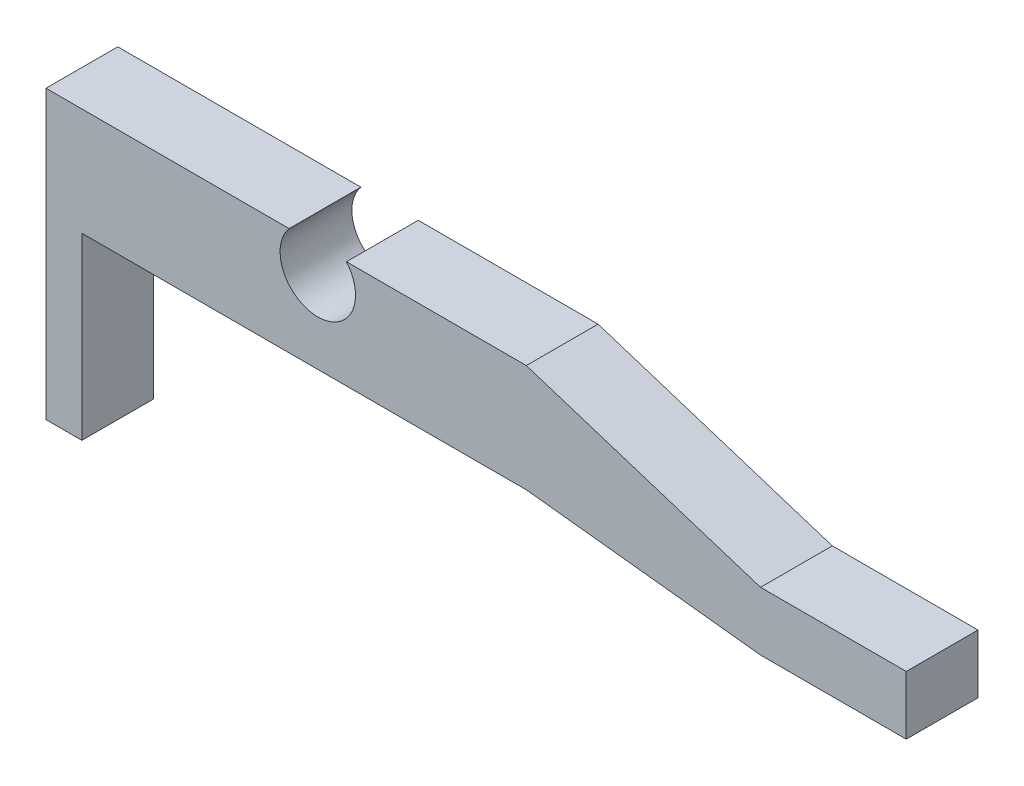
ISO-10303-21;
HEADER;
FILE_DESCRIPTION(('STEP AP214'),'2;1');
FILE_NAME('part.step','',(''),(''),'','','');
FILE_SCHEMA(('AUTOMOTIVE_DESIGN { 1 0 10303 214 1 1 1 1 }'));
ENDSEC;
DATA;
#1=APPLICATION_CONTEXT('core data for automotive mechanical design processes');
#2=APPLICATION_PROTOCOL_DEFINITION('international standard','automotive_design',2000,#1);
#3=PRODUCT_CONTEXT('',#1,'mechanical');
#4=PRODUCT('Part','Part','',(#3));
#5=PRODUCT_RELATED_PRODUCT_CATEGORY('part','',(#4));
#6=PRODUCT_DEFINITION_FORMATION('','',#4);
#7=PRODUCT_DEFINITION_CONTEXT('part definition',#1,'design');
#8=PRODUCT_DEFINITION('design','',#6,#7);
#9=PRODUCT_DEFINITION_SHAPE('','',#8);
#10=(LENGTH_UNIT() NAMED_UNIT(*) SI_UNIT(.MILLI.,.METRE.));
#11=(NAMED_UNIT(*) PLANE_ANGLE_UNIT() SI_UNIT($,.RADIAN.));
#12=(NAMED_UNIT(*) SI_UNIT($,.STERADIAN.) SOLID_ANGLE_UNIT());
#13=UNCERTAINTY_MEASURE_WITH_UNIT(LENGTH_MEASURE(1.E-05),#10,'distance_accuracy_value','');
#14=(GEOMETRIC_REPRESENTATION_CONTEXT(3) GLOBAL_UNCERTAINTY_ASSIGNED_CONTEXT((#13)) GLOBAL_UNIT_ASSIGNED_CONTEXT((#10,
#11,#12)) REPRESENTATION_CONTEXT('',''));
#15=CARTESIAN_POINT('',(0.,0.,0.));
#16=DIRECTION('',(0.,0.,1.));
#17=DIRECTION('',(1.,0.,0.));
#18=AXIS2_PLACEMENT_3D('',#15,#16,#17);
#19=CARTESIAN_POINT('',(-10.0323621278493,46.3217675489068,20.));
#20=DIRECTION('',(0.,-1.,0.));
#21=DIRECTION('',(0.,0.,-1.));
#22=AXIS2_PLACEMENT_3D('',#19,#20,#21);
#23=PLANE('',#22);
#24=DIRECTION('',(-1.,0.,0.));
#25=VECTOR('',#24,1.);
#26=CARTESIAN_POINT('',(-10.0323621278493,46.3217675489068,0.));
#27=LINE('',#26,#25);
#28=CARTESIAN_POINT('',(40.0984625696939,46.3217675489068,0.));
#29=VERTEX_POINT('',#28);
#30=CARTESIAN_POINT('',(-10.0323621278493,46.3217675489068,0.));
#31=VERTEX_POINT('',#30);
#32=EDGE_CURVE('E153',#29,#31,#27,.T.);
#33=ORIENTED_EDGE('',*,*,#32,.T.);
#34=DIRECTION('',(0.,0.,-1.));
#35=VECTOR('',#34,1.);
#36=CARTESIAN_POINT('',(-10.0323621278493,46.3217675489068,20.));
#37=LINE('',#36,#35);
#38=CARTESIAN_POINT('',(-10.0323621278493,46.3217675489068,20.));
#39=VERTEX_POINT('',#38);
#40=EDGE_CURVE('E11',#39,#31,#37,.T.);
#41=ORIENTED_EDGE('',*,*,#40,.F.);
#42=DIRECTION('',(-1.,0.,0.));
#43=VECTOR('',#42,1.);
#44=CARTESIAN_POINT('',(-10.0323621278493,46.3217675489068,20.));
#45=LINE('',#44,#43);
#46=CARTESIAN_POINT('',(40.0984625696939,46.3217675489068,20.));
#47=VERTEX_POINT('',#46);
#48=EDGE_CURVE('E175',#47,#39,#45,.T.);
#49=ORIENTED_EDGE('',*,*,#48,.F.);
#50=DIRECTION('',(0.,0.,-1.));
#51=VECTOR('',#50,1.);
#52=CARTESIAN_POINT('',(40.0984625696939,46.3217675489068,20.));
#53=LINE('',#52,#51);
#54=EDGE_CURVE('E149',#47,#29,#53,.T.);
#55=ORIENTED_EDGE('',*,*,#54,.T.);
#56=EDGE_LOOP('',(#33,#41,#49,#55));
#57=FACE_BOUND('',#56,.T.);
#58=ADVANCED_FACE('F33',(#57),#23,.F.);
#59=CARTESIAN_POINT('',(-18.0246738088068,39.4994875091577,20.));
#60=DIRECTION('',(0.,0.,-1.));
#61=DIRECTION('',(-1.,0.,0.));
#62=AXIS2_PLACEMENT_3D('',#59,#60,#61);
#63=CYLINDRICAL_SURFACE('',#62,10.5081183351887);
#64=CARTESIAN_POINT('',(-18.0246738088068,39.4994875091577,0.));
#65=DIRECTION('',(0.,0.,-1.));
#66=DIRECTION('',(1.,0.,0.));
#67=AXIS2_PLACEMENT_3D('',#64,#65,#66);
#68=CIRCLE('',#67,10.5081183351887);
#69=CARTESIAN_POINT('',(-26.0169854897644,46.3217675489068,0.));
#70=VERTEX_POINT('',#69);
#71=EDGE_CURVE('E156',#31,#70,#68,.T.);
#72=ORIENTED_EDGE('',*,*,#71,.T.);
#73=DIRECTION('',(0.,0.,-1.));
#74=VECTOR('',#73,1.);
#75=CARTESIAN_POINT('',(-26.0169854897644,46.3217675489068,20.));
#76=LINE('',#75,#74);
#77=CARTESIAN_POINT('',(-26.0169854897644,46.3217675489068,20.));
#78=VERTEX_POINT('',#77);
#79=EDGE_CURVE('E41',#78,#70,#76,.T.);
#80=ORIENTED_EDGE('',*,*,#79,.F.);
#81=CARTESIAN_POINT('',(-18.0246738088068,39.4994875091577,20.));
#82=DIRECTION('',(0.,0.,-1.));
#83=DIRECTION('',(1.,0.,0.));
#84=AXIS2_PLACEMENT_3D('',#81,#82,#83);
#85=CIRCLE('',#84,10.5081183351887);
#86=EDGE_CURVE('E104',#39,#78,#85,.T.);
#87=ORIENTED_EDGE('',*,*,#86,.F.);
#88=ORIENTED_EDGE('',*,*,#40,.T.);
#89=EDGE_LOOP('',(#72,#80,#87,#88));
#90=FACE_BOUND('',#89,.T.);
#91=ADVANCED_FACE('F253',(#90),#63,.F.);
#92=CARTESIAN_POINT('',(-93.7834032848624,46.3217675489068,20.));
#93=DIRECTION('',(0.,-1.,0.));
#94=DIRECTION('',(0.,0.,-1.));
#95=AXIS2_PLACEMENT_3D('',#92,#93,#94);
#96=PLANE('',#95);
#97=DIRECTION('',(-1.,0.,0.));
#98=VECTOR('',#97,1.);
#99=CARTESIAN_POINT('',(-93.7834032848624,46.3217675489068,0.));
#100=LINE('',#99,#98);
#101=CARTESIAN_POINT('',(-93.7834032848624,46.3217675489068,0.));
#102=VERTEX_POINT('',#101);
#103=EDGE_CURVE('E158',#70,#102,#100,.T.);
#104=ORIENTED_EDGE('',*,*,#103,.T.);
#105=DIRECTION('',(0.,0.,-1.));
#106=VECTOR('',#105,1.);
#107=CARTESIAN_POINT('',(-93.7834032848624,46.3217675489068,20.));
#108=LINE('',#107,#106);
#109=CARTESIAN_POINT('',(-93.7834032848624,46.3217675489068,20.));
#110=VERTEX_POINT('',#109);
#111=EDGE_CURVE('E194',#110,#102,#108,.T.);
#112=ORIENTED_EDGE('',*,*,#111,.F.);
#113=DIRECTION('',(-1.,0.,0.));
#114=VECTOR('',#113,1.);
#115=CARTESIAN_POINT('',(-93.7834032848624,46.3217675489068,20.));
#116=LINE('',#115,#114);
#117=EDGE_CURVE('E202',#78,#110,#116,.T.);
#118=ORIENTED_EDGE('',*,*,#117,.F.);
#119=ORIENTED_EDGE('',*,*,#79,.T.);
#120=EDGE_LOOP('',(#104,#112,#118,#119));
#121=FACE_BOUND('',#120,.T.);
#122=ADVANCED_FACE('F200',(#121),#96,.F.);
#123=CARTESIAN_POINT('',(-93.7834032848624,-33.6782324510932,20.));
#124=DIRECTION('',(1.,0.,0.));
#125=DIRECTION('',(0.,0.,-1.));
#126=AXIS2_PLACEMENT_3D('',#123,#124,#125);
#127=PLANE('',#126);
#128=DIRECTION('',(0.,-1.,0.));
#129=VECTOR('',#128,1.);
#130=CARTESIAN_POINT('',(-93.7834032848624,-33.6782324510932,0.));
#131=LINE('',#130,#129);
#132=CARTESIAN_POINT('',(-93.7834032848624,-33.6782324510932,0.));
#133=VERTEX_POINT('',#132);
#134=EDGE_CURVE('E160',#102,#133,#131,.T.);
#135=ORIENTED_EDGE('',*,*,#134,.T.);
#136=DIRECTION('',(0.,0.,-1.));
#137=VECTOR('',#136,1.);
#138=CARTESIAN_POINT('',(-93.7834032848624,-33.6782324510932,20.));
#139=LINE('',#138,#137);
#140=CARTESIAN_POINT('',(-93.7834032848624,-33.6782324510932,20.));
#141=VERTEX_POINT('',#140);
#142=EDGE_CURVE('E191',#141,#133,#139,.T.);
#143=ORIENTED_EDGE('',*,*,#142,.F.);
#144=DIRECTION('',(0.,-1.,0.));
#145=VECTOR('',#144,1.);
#146=CARTESIAN_POINT('',(-93.7834032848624,-33.6782324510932,20.));
#147=LINE('',#146,#145);
#148=EDGE_CURVE('E220',#110,#141,#147,.T.);
#149=ORIENTED_EDGE('',*,*,#148,.F.);
#150=ORIENTED_EDGE('',*,*,#111,.T.);
#151=EDGE_LOOP('',(#135,#143,#149,#150));
#152=FACE_BOUND('',#151,.T.);
#153=ADVANCED_FACE('F211',(#152),#127,.F.);
#154=CARTESIAN_POINT('',(-83.7834032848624,-33.6782324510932,20.));
#155=DIRECTION('',(0.,1.,0.));
#156=DIRECTION('',(0.,0.,1.));
#157=AXIS2_PLACEMENT_3D('',#154,#155,#156);
#158=PLANE('',#157);
#159=DIRECTION('',(1.,0.,0.));
#160=VECTOR('',#159,1.);
#161=CARTESIAN_POINT('',(-83.7834032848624,-33.6782324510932,0.));
#162=LINE('',#161,#160);
#163=CARTESIAN_POINT('',(-83.7834032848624,-33.6782324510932,0.));
#164=VERTEX_POINT('',#163);
#165=EDGE_CURVE('E162',#133,#164,#162,.T.);
#166=ORIENTED_EDGE('',*,*,#165,.T.);
#167=DIRECTION('',(0.,0.,-1.));
#168=VECTOR('',#167,1.);
#169=CARTESIAN_POINT('',(-83.7834032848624,-33.6782324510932,20.));
#170=LINE('',#169,#168);
#171=CARTESIAN_POINT('',(-83.7834032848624,-33.6782324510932,20.));
#172=VERTEX_POINT('',#171);
#173=EDGE_CURVE('E188',#172,#164,#170,.T.);
#174=ORIENTED_EDGE('',*,*,#173,.F.);
#175=DIRECTION('',(1.,0.,0.));
#176=VECTOR('',#175,1.);
#177=CARTESIAN_POINT('',(-83.7834032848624,-33.6782324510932,20.));
#178=LINE('',#177,#176);
#179=EDGE_CURVE('E217',#141,#172,#178,.T.);
#180=ORIENTED_EDGE('',*,*,#179,.F.);
#181=ORIENTED_EDGE('',*,*,#142,.T.);
#182=EDGE_LOOP('',(#166,#174,#180,#181));
#183=FACE_BOUND('',#182,.T.);
#184=ADVANCED_FACE('F215',(#183),#158,.F.);
#185=CARTESIAN_POINT('',(-83.7834032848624,16.3217675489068,20.));
#186=DIRECTION('',(-1.,0.,0.));
#187=DIRECTION('',(0.,0.,1.));
#188=AXIS2_PLACEMENT_3D('',#185,#186,#187);
#189=PLANE('',#188);
#190=DIRECTION('',(0.,1.,0.));
#191=VECTOR('',#190,1.);
#192=CARTESIAN_POINT('',(-83.7834032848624,16.3217675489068,0.));
#193=LINE('',#192,#191);
#194=CARTESIAN_POINT('',(-83.7834032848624,16.3217675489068,0.));
#195=VERTEX_POINT('',#194);
#196=EDGE_CURVE('E164',#164,#195,#193,.T.);
#197=ORIENTED_EDGE('',*,*,#196,.T.);
#198=DIRECTION('',(0.,0.,-1.));
#199=VECTOR('',#198,1.);
#200=CARTESIAN_POINT('',(-83.7834032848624,16.3217675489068,20.));
#201=LINE('',#200,#199);
#202=CARTESIAN_POINT('',(-83.7834032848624,16.3217675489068,20.));
#203=VERTEX_POINT('',#202);
#204=EDGE_CURVE('E185',#203,#195,#201,.T.);
#205=ORIENTED_EDGE('',*,*,#204,.F.);
#206=DIRECTION('',(0.,1.,0.));
#207=VECTOR('',#206,1.);
#208=CARTESIAN_POINT('',(-83.7834032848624,16.3217675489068,20.));
#209=LINE('',#208,#207);
#210=EDGE_CURVE('E219',#172,#203,#209,.T.);
#211=ORIENTED_EDGE('',*,*,#210,.F.);
#212=ORIENTED_EDGE('',*,*,#173,.T.);
#213=EDGE_LOOP('',(#197,#205,#211,#212));
#214=FACE_BOUND('',#213,.T.);
#215=ADVANCED_FACE('F266',(#214),#189,.F.);
#216=CARTESIAN_POINT('',(40.0984625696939,16.3217675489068,20.));
#217=DIRECTION('',(0.,1.,0.));
#218=DIRECTION('',(-1.,0.,0.));
#219=AXIS2_PLACEMENT_3D('',#216,#217,#218);
#220=PLANE('',#219);
#221=DIRECTION('',(1.,0.,0.));
#222=VECTOR('',#221,1.);
#223=CARTESIAN_POINT('',(40.0984625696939,16.3217675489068,0.));
#224=LINE('',#223,#222);
#225=CARTESIAN_POINT('',(40.0984625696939,16.3217675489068,0.));
#226=VERTEX_POINT('',#225);
#227=EDGE_CURVE('E166',#195,#226,#224,.T.);
#228=ORIENTED_EDGE('',*,*,#227,.T.);
#229=DIRECTION('',(0.,0.,-1.));
#230=VECTOR('',#229,1.);
#231=CARTESIAN_POINT('',(40.0984625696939,16.3217675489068,20.));
#232=LINE('',#231,#230);
#233=CARTESIAN_POINT('',(40.0984625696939,16.3217675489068,20.));
#234=VERTEX_POINT('',#233);
#235=EDGE_CURVE('E182',#234,#226,#232,.T.);
#236=ORIENTED_EDGE('',*,*,#235,.F.);
#237=DIRECTION('',(1.,0.,0.));
#238=VECTOR('',#237,1.);
#239=CARTESIAN_POINT('',(40.0984625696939,16.3217675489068,20.));
#240=LINE('',#239,#238);
#241=EDGE_CURVE('E222',#203,#234,#240,.T.);
#242=ORIENTED_EDGE('',*,*,#241,.F.);
#243=ORIENTED_EDGE('',*,*,#204,.T.);
#244=EDGE_LOOP('',(#228,#236,#242,#243));
#245=FACE_BOUND('',#244,.T.);
#246=ADVANCED_FACE('F269',(#245),#220,.F.);
#247=CARTESIAN_POINT('',(105.375029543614,9.07718764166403,20.));
#248=DIRECTION('',(0.110305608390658,0.99389771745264,0.));
#249=DIRECTION('',(-0.99389771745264,0.110305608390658,0.));
#250=AXIS2_PLACEMENT_3D('',#247,#248,#249);
#251=PLANE('',#250);
#252=DIRECTION('',(0.99389771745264,-0.110305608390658,0.));
#253=VECTOR('',#252,1.);
#254=CARTESIAN_POINT('',(105.375029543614,9.07718764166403,0.));
#255=LINE('',#254,#253);
#256=CARTESIAN_POINT('',(105.375029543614,9.07718764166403,0.));
#257=VERTEX_POINT('',#256);
#258=EDGE_CURVE('E168',#226,#257,#255,.T.);
#259=ORIENTED_EDGE('',*,*,#258,.T.);
#260=DIRECTION('',(0.,0.,-1.));
#261=VECTOR('',#260,1.);
#262=CARTESIAN_POINT('',(105.375029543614,9.07718764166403,20.));
#263=LINE('',#262,#261);
#264=CARTESIAN_POINT('',(105.375029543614,9.07718764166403,20.));
#265=VERTEX_POINT('',#264);
#266=EDGE_CURVE('E179',#265,#257,#263,.T.);
#267=ORIENTED_EDGE('',*,*,#266,.F.);
#268=DIRECTION('',(0.99389771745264,-0.110305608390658,0.));
#269=VECTOR('',#268,1.);
#270=CARTESIAN_POINT('',(105.375029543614,9.07718764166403,20.));
#271=LINE('',#270,#269);
#272=EDGE_CURVE('E228',#234,#265,#271,.T.);
#273=ORIENTED_EDGE('',*,*,#272,.F.);
#274=ORIENTED_EDGE('',*,*,#235,.T.);
#275=EDGE_LOOP('',(#259,#267,#273,#274));
#276=FACE_BOUND('',#275,.T.);
#277=ADVANCED_FACE('F234',(#276),#251,.F.);
#278=CARTESIAN_POINT('',(145.992720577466,9.07718764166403,20.));
#279=DIRECTION('',(0.,1.,0.));
#280=DIRECTION('',(-1.,0.,0.));
#281=AXIS2_PLACEMENT_3D('',#278,#279,#280);
#282=PLANE('',#281);
#283=DIRECTION('',(1.,0.,0.));
#284=VECTOR('',#283,1.);
#285=CARTESIAN_POINT('',(145.992720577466,9.07718764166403,0.));
#286=LINE('',#285,#284);
#287=CARTESIAN_POINT('',(145.992720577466,9.07718764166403,0.));
#288=VERTEX_POINT('',#287);
#289=EDGE_CURVE('E170',#257,#288,#286,.T.);
#290=ORIENTED_EDGE('',*,*,#289,.T.);
#291=DIRECTION('',(0.,0.,-1.));
#292=VECTOR('',#291,1.);
#293=CARTESIAN_POINT('',(145.992720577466,9.07718764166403,20.));
#294=LINE('',#293,#292);
#295=CARTESIAN_POINT('',(145.992720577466,9.07718764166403,20.));
#296=VERTEX_POINT('',#295);
#297=EDGE_CURVE('E144',#296,#288,#294,.T.);
#298=ORIENTED_EDGE('',*,*,#297,.F.);
#299=DIRECTION('',(1.,0.,0.));
#300=VECTOR('',#299,1.);
#301=CARTESIAN_POINT('',(145.992720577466,9.07718764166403,20.));
#302=LINE('',#301,#300);
#303=EDGE_CURVE('E135',#265,#296,#302,.T.);
#304=ORIENTED_EDGE('',*,*,#303,.F.);
#305=ORIENTED_EDGE('',*,*,#266,.T.);
#306=EDGE_LOOP('',(#290,#298,#304,#305));
#307=FACE_BOUND('',#306,.T.);
#308=ADVANCED_FACE('F238',(#307),#282,.F.);
#309=CARTESIAN_POINT('',(145.992720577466,25.4332661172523,20.));
#310=DIRECTION('',(-1.,0.,0.));
#311=DIRECTION('',(0.,0.,1.));
#312=AXIS2_PLACEMENT_3D('',#309,#310,#311);
#313=PLANE('',#312);
#314=DIRECTION('',(0.,1.,0.));
#315=VECTOR('',#314,1.);
#316=CARTESIAN_POINT('',(145.992720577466,25.4332661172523,0.));
#317=LINE('',#316,#315);
#318=CARTESIAN_POINT('',(145.992720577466,25.4332661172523,0.));
#319=VERTEX_POINT('',#318);
#320=EDGE_CURVE('E143',#288,#319,#317,.T.);
#321=ORIENTED_EDGE('',*,*,#320,.T.);
#322=DIRECTION('',(0.,0.,-1.));
#323=VECTOR('',#322,1.);
#324=CARTESIAN_POINT('',(145.992720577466,25.4332661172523,20.));
#325=LINE('',#324,#323);
#326=CARTESIAN_POINT('',(145.992720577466,25.4332661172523,20.));
#327=VERTEX_POINT('',#326);
#328=EDGE_CURVE('E140',#327,#319,#325,.T.);
#329=ORIENTED_EDGE('',*,*,#328,.F.);
#330=DIRECTION('',(0.,1.,0.));
#331=VECTOR('',#330,1.);
#332=CARTESIAN_POINT('',(145.992720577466,25.4332661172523,20.));
#333=LINE('',#332,#331);
#334=EDGE_CURVE('E129',#296,#327,#333,.T.);
#335=ORIENTED_EDGE('',*,*,#334,.F.);
#336=ORIENTED_EDGE('',*,*,#297,.T.);
#337=EDGE_LOOP('',(#321,#329,#335,#336));
#338=FACE_BOUND('',#337,.T.);
#339=ADVANCED_FACE('F141',(#338),#313,.F.);
#340=CARTESIAN_POINT('',(105.375029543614,25.4332661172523,20.));
#341=DIRECTION('',(0.,-1.,0.));
#342=DIRECTION('',(0.,0.,-1.));
#343=AXIS2_PLACEMENT_3D('',#340,#341,#342);
#344=PLANE('',#343);
#345=DIRECTION('',(-1.,0.,0.));
#346=VECTOR('',#345,1.);
#347=CARTESIAN_POINT('',(105.375029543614,25.4332661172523,0.));
#348=LINE('',#347,#346);
#349=CARTESIAN_POINT('',(105.375029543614,25.4332661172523,0.));
#350=VERTEX_POINT('',#349);
#351=EDGE_CURVE('E90',#319,#350,#348,.T.);
#352=ORIENTED_EDGE('',*,*,#351,.T.);
#353=DIRECTION('',(0.,0.,-1.));
#354=VECTOR('',#353,1.);
#355=CARTESIAN_POINT('',(105.375029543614,25.4332661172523,20.));
#356=LINE('',#355,#354);
#357=CARTESIAN_POINT('',(105.375029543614,25.4332661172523,20.));
#358=VERTEX_POINT('',#357);
#359=EDGE_CURVE('E145',#358,#350,#356,.T.);
#360=ORIENTED_EDGE('',*,*,#359,.F.);
#361=DIRECTION('',(-1.,0.,0.));
#362=VECTOR('',#361,1.);
#363=CARTESIAN_POINT('',(105.375029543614,25.4332661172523,20.));
#364=LINE('',#363,#362);
#365=EDGE_CURVE('E133',#327,#358,#364,.T.);
#366=ORIENTED_EDGE('',*,*,#365,.F.);
#367=ORIENTED_EDGE('',*,*,#328,.T.);
#368=EDGE_LOOP('',(#352,#360,#366,#367));
#369=FACE_BOUND('',#368,.T.);
#370=ADVANCED_FACE('F147',(#369),#344,.F.);
#371=CARTESIAN_POINT('',(40.0984625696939,46.3217675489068,20.));
#372=DIRECTION('',(-0.304775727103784,-0.952424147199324,0.));
#373=DIRECTION('',(0.952424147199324,-0.304775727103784,0.));
#374=AXIS2_PLACEMENT_3D('',#371,#372,#373);
#375=PLANE('',#374);
#376=DIRECTION('',(-0.952424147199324,0.304775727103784,0.));
#377=VECTOR('',#376,1.);
#378=CARTESIAN_POINT('',(40.0984625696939,46.3217675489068,0.));
#379=LINE('',#378,#377);
#380=EDGE_CURVE('E96',#350,#29,#379,.T.);
#381=ORIENTED_EDGE('',*,*,#380,.T.);
#382=ORIENTED_EDGE('',*,*,#54,.F.);
#383=DIRECTION('',(-0.952424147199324,0.304775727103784,0.));
#384=VECTOR('',#383,1.);
#385=CARTESIAN_POINT('',(40.0984625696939,46.3217675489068,20.));
#386=LINE('',#385,#384);
#387=EDGE_CURVE('E49',#358,#47,#386,.T.);
#388=ORIENTED_EDGE('',*,*,#387,.F.);
#389=ORIENTED_EDGE('',*,*,#359,.T.);
#390=EDGE_LOOP('',(#381,#382,#388,#389));
#391=FACE_BOUND('',#390,.T.);
#392=ADVANCED_FACE('F242',(#391),#375,.F.);
#393=CARTESIAN_POINT('',(-18.0246738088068,39.4994875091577,20.));
#394=DIRECTION('',(0.,0.,1.));
#395=DIRECTION('',(1.,0.,0.));
#396=AXIS2_PLACEMENT_3D('',#393,#394,#395);
#397=PLANE('',#396);
#398=ORIENTED_EDGE('',*,*,#48,.T.);
#399=ORIENTED_EDGE('',*,*,#86,.T.);
#400=ORIENTED_EDGE('',*,*,#117,.T.);
#401=ORIENTED_EDGE('',*,*,#148,.T.);
#402=ORIENTED_EDGE('',*,*,#179,.T.);
#403=ORIENTED_EDGE('',*,*,#210,.T.);
#404=ORIENTED_EDGE('',*,*,#241,.T.);
#405=ORIENTED_EDGE('',*,*,#272,.T.);
#406=ORIENTED_EDGE('',*,*,#303,.T.);
#407=ORIENTED_EDGE('',*,*,#334,.T.);
#408=ORIENTED_EDGE('',*,*,#365,.T.);
#409=ORIENTED_EDGE('',*,*,#387,.T.);
#410=EDGE_LOOP('',(#398,#399,#400,#401,#402,#403,#404,#405,#406,#407,#408,#409));
#411=FACE_BOUND('',#410,.T.);
#412=ADVANCED_FACE('F131',(#411),#397,.T.);
#413=CARTESIAN_POINT('',(-18.0246738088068,39.4994875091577,0.));
#414=DIRECTION('',(0.,0.,1.));
#415=DIRECTION('',(1.,0.,0.));
#416=AXIS2_PLACEMENT_3D('',#413,#414,#415);
#417=PLANE('',#416);
#418=ORIENTED_EDGE('',*,*,#32,.F.);
#419=ORIENTED_EDGE('',*,*,#380,.F.);
#420=ORIENTED_EDGE('',*,*,#351,.F.);
#421=ORIENTED_EDGE('',*,*,#320,.F.);
#422=ORIENTED_EDGE('',*,*,#289,.F.);
#423=ORIENTED_EDGE('',*,*,#258,.F.);
#424=ORIENTED_EDGE('',*,*,#227,.F.);
#425=ORIENTED_EDGE('',*,*,#196,.F.);
#426=ORIENTED_EDGE('',*,*,#165,.F.);
#427=ORIENTED_EDGE('',*,*,#134,.F.);
#428=ORIENTED_EDGE('',*,*,#103,.F.);
#429=ORIENTED_EDGE('',*,*,#71,.F.);
#430=EDGE_LOOP('',(#418,#419,#420,#421,#422,#423,#424,#425,#426,#427,#428,#429));
#431=FACE_BOUND('',#430,.T.);
#432=ADVANCED_FACE('F206',(#431),#417,.F.);
#433=CLOSED_SHELL('',(#58,#91,#122,#153,#184,#215,#246,#277,#308,#339,#370,#392,#412,#432));
#434=MANIFOLD_SOLID_BREP('B2',#433);
#435=ADVANCED_BREP_SHAPE_REPRESENTATION('',(#18,#434),#14);
#436=SHAPE_DEFINITION_REPRESENTATION(#9,#435);
ENDSEC;
END-ISO-10303-21;
